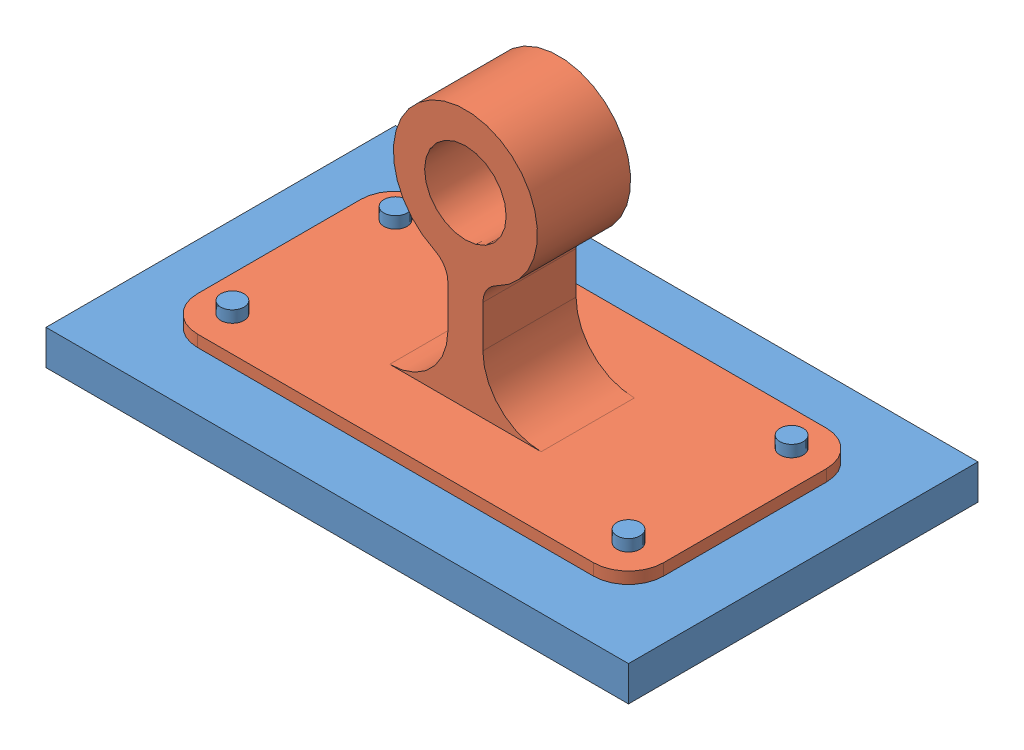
SolidWorks assembly Assem1.sldasm, configuration Default (file format 11000). Lengths in mm.
Overall size (250 130.92 150).
2 component instances, 2 part files, 2 mates.
Components (placement in the parent):
- base-1: base.SLDPRT [Default] at (107.5224 121.7519 190.3198) size (250 25 150)
- holder-1: holder.SLDPRT [Default] at (7.5224 131.7519 240.3198) size (200 120.92 100)
Mates (geometry in assembly coordinates):
- Coincident1: coincident: plane of base-1 through (192.5224 131.7519 155.3198) normal (0 1 0); plane of holder-1 through (22.5224 131.7519 225.3198) normal (0 -1 0)
- Coincident2: coincident: cylinder of base-1 through (22.5224 146.7519 225.3198) axis (0 -1 0) radius 5; circle of holder-1
